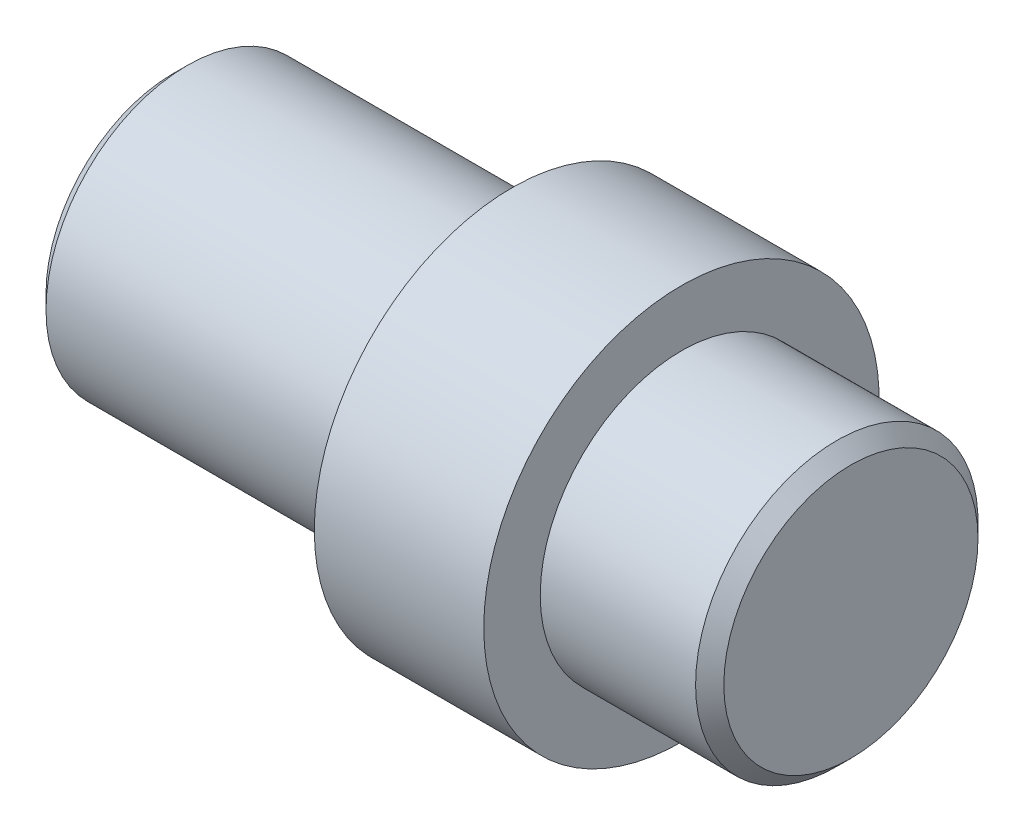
ISO-10303-21;
HEADER;
FILE_DESCRIPTION(('STEP AP214'),'2;1');
FILE_NAME('part.step','',(''),(''),'','','');
FILE_SCHEMA(('AUTOMOTIVE_DESIGN { 1 0 10303 214 1 1 1 1 }'));
ENDSEC;
DATA;
#1=APPLICATION_CONTEXT('core data for automotive mechanical design processes');
#2=APPLICATION_PROTOCOL_DEFINITION('international standard','automotive_design',2000,#1);
#3=PRODUCT_CONTEXT('',#1,'mechanical');
#4=PRODUCT('Part','Part','',(#3));
#5=PRODUCT_RELATED_PRODUCT_CATEGORY('part','',(#4));
#6=PRODUCT_DEFINITION_FORMATION('','',#4);
#7=PRODUCT_DEFINITION_CONTEXT('part definition',#1,'design');
#8=PRODUCT_DEFINITION('design','',#6,#7);
#9=PRODUCT_DEFINITION_SHAPE('','',#8);
#10=(LENGTH_UNIT() NAMED_UNIT(*) SI_UNIT(.MILLI.,.METRE.));
#11=(NAMED_UNIT(*) PLANE_ANGLE_UNIT() SI_UNIT($,.RADIAN.));
#12=(NAMED_UNIT(*) SI_UNIT($,.STERADIAN.) SOLID_ANGLE_UNIT());
#13=UNCERTAINTY_MEASURE_WITH_UNIT(LENGTH_MEASURE(1.E-05),#10,'distance_accuracy_value','');
#14=(GEOMETRIC_REPRESENTATION_CONTEXT(3) GLOBAL_UNCERTAINTY_ASSIGNED_CONTEXT((#13)) GLOBAL_UNIT_ASSIGNED_CONTEXT((#10,
#11,#12)) REPRESENTATION_CONTEXT('',''));
#15=CARTESIAN_POINT('',(0.,0.,0.));
#16=DIRECTION('',(0.,0.,1.));
#17=DIRECTION('',(1.,0.,0.));
#18=AXIS2_PLACEMENT_3D('',#15,#16,#17);
#19=CARTESIAN_POINT('',(0.,0.,0.));
#20=DIRECTION('',(1.,0.,0.));
#21=DIRECTION('',(0.,0.,-1.));
#22=AXIS2_PLACEMENT_3D('',#19,#20,#21);
#23=PLANE('',#22);
#24=CARTESIAN_POINT('',(0.,0.,0.));
#25=DIRECTION('',(1.,0.,0.));
#26=DIRECTION('',(0.,0.,-1.));
#27=AXIS2_PLACEMENT_3D('',#24,#25,#26);
#28=CIRCLE('',#27,4.5);
#29=CARTESIAN_POINT('',(0.,0.,-4.5));
#30=VERTEX_POINT('',#29);
#31=EDGE_CURVE('E30',#30,#30,#28,.F.);
#32=ORIENTED_EDGE('',*,*,#31,.T.);
#33=EDGE_LOOP('',(#32));
#34=FACE_BOUND('',#33,.T.);
#35=ADVANCED_FACE('F24',(#34),#23,.F.);
#36=CARTESIAN_POINT('',(0.,0.,0.));
#37=DIRECTION('',(-1.,0.,0.));
#38=DIRECTION('',(0.,0.,1.));
#39=AXIS2_PLACEMENT_3D('',#36,#37,#38);
#40=CYLINDRICAL_SURFACE('',#39,5.);
#41=CARTESIAN_POINT('',(0.500000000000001,0.,0.));
#42=DIRECTION('',(1.,0.,0.));
#43=DIRECTION('',(0.,0.,-1.));
#44=AXIS2_PLACEMENT_3D('',#41,#42,#43);
#45=CIRCLE('',#44,5.);
#46=CARTESIAN_POINT('',(0.500000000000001,0.,-5.));
#47=VERTEX_POINT('',#46);
#48=EDGE_CURVE('E10',#47,#47,#45,.T.);
#49=ORIENTED_EDGE('',*,*,#48,.T.);
#50=EDGE_LOOP('',(#49));
#51=FACE_BOUND('',#50,.T.);
#52=CARTESIAN_POINT('',(12.,0.,0.));
#53=DIRECTION('',(-1.,0.,0.));
#54=DIRECTION('',(0.,0.,1.));
#55=AXIS2_PLACEMENT_3D('',#52,#53,#54);
#56=CIRCLE('',#55,5.);
#57=CARTESIAN_POINT('',(12.,0.,5.));
#58=VERTEX_POINT('',#57);
#59=EDGE_CURVE('E43',#58,#58,#56,.T.);
#60=ORIENTED_EDGE('',*,*,#59,.T.);
#61=EDGE_LOOP('',(#60));
#62=FACE_BOUND('',#61,.T.);
#63=ADVANCED_FACE('F74',(#51,#62),#40,.T.);
#64=CARTESIAN_POINT('',(12.,5.,0.));
#65=DIRECTION('',(1.,0.,0.));
#66=DIRECTION('',(0.,0.,-1.));
#67=AXIS2_PLACEMENT_3D('',#64,#65,#66);
#68=PLANE('',#67);
#69=ORIENTED_EDGE('',*,*,#59,.F.);
#70=EDGE_LOOP('',(#69));
#71=FACE_BOUND('',#70,.T.);
#72=CARTESIAN_POINT('',(12.,0.,0.));
#73=DIRECTION('',(-1.,0.,0.));
#74=DIRECTION('',(0.,0.,1.));
#75=AXIS2_PLACEMENT_3D('',#72,#73,#74);
#76=CIRCLE('',#75,7.);
#77=CARTESIAN_POINT('',(12.,0.,7.));
#78=VERTEX_POINT('',#77);
#79=EDGE_CURVE('E46',#78,#78,#76,.T.);
#80=ORIENTED_EDGE('',*,*,#79,.T.);
#81=EDGE_LOOP('',(#80));
#82=FACE_BOUND('',#81,.T.);
#83=ADVANCED_FACE('F78',(#71,#82),#68,.F.);
#84=CARTESIAN_POINT('',(0.,0.,0.));
#85=DIRECTION('',(-1.,0.,0.));
#86=DIRECTION('',(0.,0.,1.));
#87=AXIS2_PLACEMENT_3D('',#84,#85,#86);
#88=CYLINDRICAL_SURFACE('',#87,7.);
#89=ORIENTED_EDGE('',*,*,#79,.F.);
#90=EDGE_LOOP('',(#89));
#91=FACE_BOUND('',#90,.T.);
#92=CARTESIAN_POINT('',(18.,0.,0.));
#93=DIRECTION('',(-1.,0.,0.));
#94=DIRECTION('',(0.,0.,1.));
#95=AXIS2_PLACEMENT_3D('',#92,#93,#94);
#96=CIRCLE('',#95,7.);
#97=CARTESIAN_POINT('',(18.,0.,7.));
#98=VERTEX_POINT('',#97);
#99=EDGE_CURVE('E49',#98,#98,#96,.T.);
#100=ORIENTED_EDGE('',*,*,#99,.T.);
#101=EDGE_LOOP('',(#100));
#102=FACE_BOUND('',#101,.T.);
#103=ADVANCED_FACE('F70',(#91,#102),#88,.T.);
#104=CARTESIAN_POINT('',(18.,7.,0.));
#105=DIRECTION('',(-1.,0.,0.));
#106=DIRECTION('',(0.,0.,1.));
#107=AXIS2_PLACEMENT_3D('',#104,#105,#106);
#108=PLANE('',#107);
#109=ORIENTED_EDGE('',*,*,#99,.F.);
#110=EDGE_LOOP('',(#109));
#111=FACE_BOUND('',#110,.T.);
#112=CARTESIAN_POINT('',(18.,0.,0.));
#113=DIRECTION('',(-1.,0.,0.));
#114=DIRECTION('',(0.,0.,1.));
#115=AXIS2_PLACEMENT_3D('',#112,#113,#114);
#116=CIRCLE('',#115,5.);
#117=CARTESIAN_POINT('',(18.,0.,5.));
#118=VERTEX_POINT('',#117);
#119=EDGE_CURVE('E52',#118,#118,#116,.T.);
#120=ORIENTED_EDGE('',*,*,#119,.T.);
#121=EDGE_LOOP('',(#120));
#122=FACE_BOUND('',#121,.T.);
#123=ADVANCED_FACE('F56',(#111,#122),#108,.F.);
#124=CARTESIAN_POINT('',(0.,0.,0.));
#125=DIRECTION('',(-1.,0.,0.));
#126=DIRECTION('',(0.,0.,1.));
#127=AXIS2_PLACEMENT_3D('',#124,#125,#126);
#128=CYLINDRICAL_SURFACE('',#127,5.);
#129=CARTESIAN_POINT('',(23.5,0.,0.));
#130=DIRECTION('',(-1.,0.,0.));
#131=DIRECTION('',(0.,0.,1.));
#132=AXIS2_PLACEMENT_3D('',#129,#130,#131);
#133=CIRCLE('',#132,5.);
#134=CARTESIAN_POINT('',(23.5,0.,5.));
#135=VERTEX_POINT('',#134);
#136=EDGE_CURVE('E38',#135,#135,#133,.T.);
#137=ORIENTED_EDGE('',*,*,#136,.T.);
#138=EDGE_LOOP('',(#137));
#139=FACE_BOUND('',#138,.T.);
#140=ORIENTED_EDGE('',*,*,#119,.F.);
#141=EDGE_LOOP('',(#140));
#142=FACE_BOUND('',#141,.T.);
#143=ADVANCED_FACE('F58',(#139,#142),#128,.T.);
#144=CARTESIAN_POINT('',(24.,5.,0.));
#145=DIRECTION('',(-1.,0.,0.));
#146=DIRECTION('',(0.,0.,1.));
#147=AXIS2_PLACEMENT_3D('',#144,#145,#146);
#148=PLANE('',#147);
#149=CARTESIAN_POINT('',(24.,0.,0.));
#150=DIRECTION('',(-1.,0.,0.));
#151=DIRECTION('',(0.,0.,1.));
#152=AXIS2_PLACEMENT_3D('',#149,#150,#151);
#153=CIRCLE('',#152,4.49999999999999);
#154=CARTESIAN_POINT('',(24.,0.,4.49999999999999));
#155=VERTEX_POINT('',#154);
#156=EDGE_CURVE('E34',#155,#155,#153,.F.);
#157=ORIENTED_EDGE('',*,*,#156,.T.);
#158=EDGE_LOOP('',(#157));
#159=FACE_BOUND('',#158,.T.);
#160=ADVANCED_FACE('F60',(#159),#148,.F.);
#161=CARTESIAN_POINT('',(23.5,0.,0.));
#162=DIRECTION('',(-1.,0.,0.));
#163=DIRECTION('',(0.,0.,1.));
#164=AXIS2_PLACEMENT_3D('',#161,#162,#163);
#165=CONICAL_SURFACE('',#164,5.,0.785398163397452);
#166=ORIENTED_EDGE('',*,*,#156,.F.);
#167=EDGE_LOOP('',(#166));
#168=FACE_BOUND('',#167,.T.);
#169=ORIENTED_EDGE('',*,*,#136,.F.);
#170=EDGE_LOOP('',(#169));
#171=FACE_BOUND('',#170,.T.);
#172=ADVANCED_FACE('F67',(#168,#171),#165,.T.);
#173=CARTESIAN_POINT('',(0.,0.,0.));
#174=DIRECTION('',(1.,0.,0.));
#175=DIRECTION('',(0.,0.,-1.));
#176=AXIS2_PLACEMENT_3D('',#173,#174,#175);
#177=CONICAL_SURFACE('',#176,4.5,0.785398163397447);
#178=ORIENTED_EDGE('',*,*,#48,.F.);
#179=EDGE_LOOP('',(#178));
#180=FACE_BOUND('',#179,.T.);
#181=ORIENTED_EDGE('',*,*,#31,.F.);
#182=EDGE_LOOP('',(#181));
#183=FACE_BOUND('',#182,.T.);
#184=ADVANCED_FACE('F113',(#180,#183),#177,.T.);
#185=CLOSED_SHELL('',(#35,#63,#83,#103,#123,#143,#160,#172,#184));
#186=MANIFOLD_SOLID_BREP('B2',#185);
#187=ADVANCED_BREP_SHAPE_REPRESENTATION('',(#18,#186),#14);
#188=SHAPE_DEFINITION_REPRESENTATION(#9,#187);
ENDSEC;
END-ISO-10303-21;
